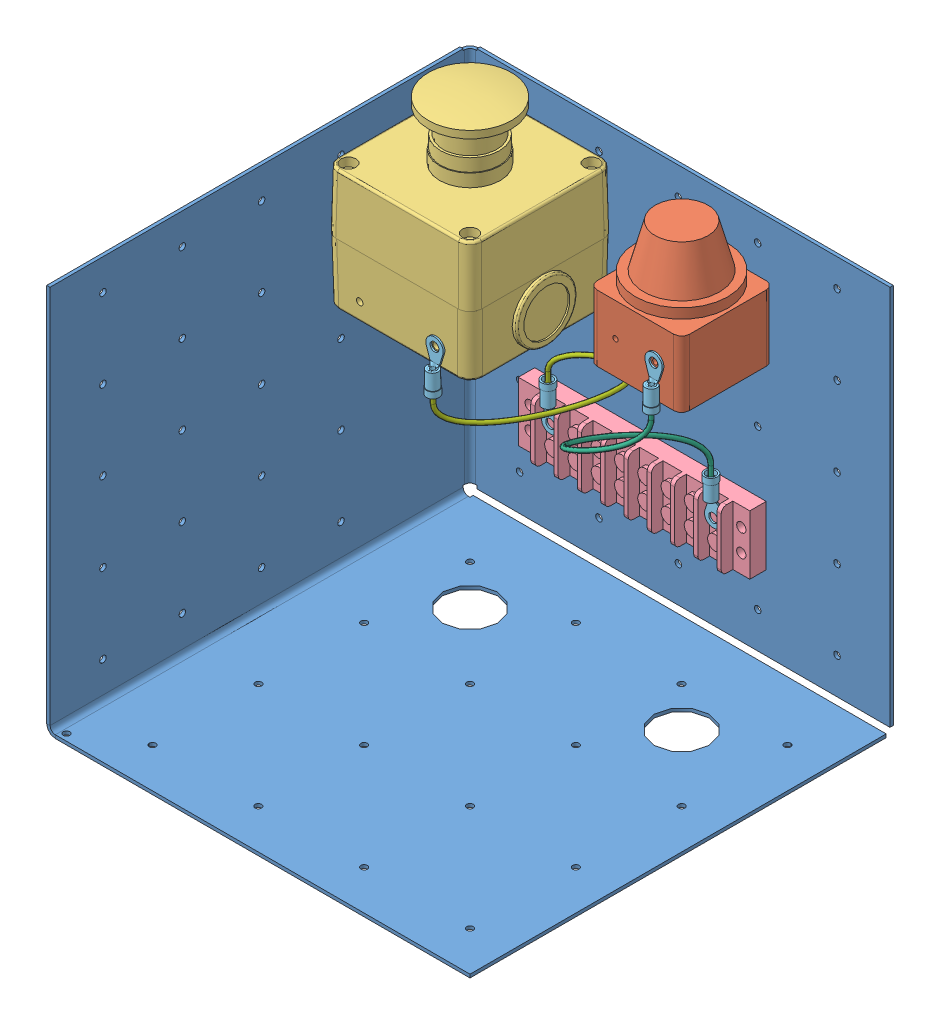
SolidWorks assembly Split_Route.SLDASM, configuration Default (file format 13000). Lengths in mm.
Overall size (203.2 215.84 203.2).
12 component instances, 7 part files, 9 mates.
Components (placement in the parent):
- box4-1: box4.SLDPRT [Default] at origin size (203.2 186.37 203.2)
- light_4-1: light_4.SLDPRT [Default] at (292.1 186.3725 177.8) x (-1 0 0) z (0 -1 0) size (44.45 44.45 58.74)
- E-StopSwitch_4-1: E-StopSwitch_4.SLDPRT [Default] at (50.8 157.9245 50.8) x (0 0 1) z (0 1 0) size (70 92.29 87.45)
- SW3dPS-Terminal Block_4-2: SW3dPS-Terminal Block_4.SLDPRT [Default] at (143.764 67.6275 1.5875) x (-1 0 0) z (0 0 1) size (111.13 28.45 19.91)
- Line_B-1: Line_B.sldasm [Default] at origin size (52.07 120.14 69.94)
  - ring_term_awg-14_4-15: ring_term_awg-14_4.SLDPRT [Default] at (129.032 58.7375 12.2873) x (0 1 0) z (1 0 0) size (27.02 6.1 8.38)
  - ring_term_awg-14_4-16: ring_term_awg-14_4.SLDPRT [Default] at (161.925 170.4975 73.8188) x (0 -1 0) z (-1 0 0) size (27.02 6.1 8.38)
  - Cable-Ring_0-6_4-1: Cable-Ring_0-6_4.sldprt [Default] at origin size (48.88 86.11 67.9)
- Line_A-1: Line_A.sldasm [Default] at origin size (47.09 86.58 83.79)
  - ring_term_awg-14_4-15: ring_term_awg-14_4.SLDPRT [Default] at (69.1868 136.9038 86.227) x (0 -0.999848 -0.017452) z (-1 0 0) size (27.02 6.1 8.38)
  - ring_term_awg-14_4-16: ring_term_awg-14_4.SLDPRT [Default] at (50.8 58.7375 12.2873) x (0 1 0) z (1 0 0) size (27.02 6.1 8.38)
  - Cable-Ring_0-6-001_4-1: Cable-Ring_0-6-001_4.sldprt [Default] at origin size (43.9 52.51 81.44)
Mates (geometry in assembly coordinates):
- Coincident3: coincident: line of box4-1 through (1.5875 186.3725 4.9213) axis (0 0 1); plane of E-StopSwitch_4-1 through (15.8 186.3725 15.8) normal (0 1 0)
- Concentric3: concentric: cylinder of box4-1 through (50.8 0 50.8) axis (0 -1 0) radius 13.081; cylinder of E-StopSwitch_4-1 through (50.8 192.4685 50.8) axis (0 -1 0) radius 14.5415
- Coincident5: coincident: line of box4-1 through (203.2 186.3725 1.5875) axis (-1 0 0); plane of light_4-1 through (133.985 186.3725 32.385) normal (0 1 0)
- Concentric4: concentric: cylinder of box4-1 through (152.4 0 50.8) axis (0 -1 0) radius 13.081; cylinder of light_4-1 through (152.4 186.3725 50.8) axis (0 -1 0) radius 22.225
- Parallel2: parallel: plane of light_4-1 through (133.985 154.6225 28.575) normal (0 0 -1); plane of box4-1 through (203.2 0 1.5875) normal (0 0 1)
- Parallel4: parallel: plane of box4-1 through (1.5875 190.5 203.2) normal (1 0 0); line of E-StopSwitch_4-1 through (85.8 157.9245 80.2636) axis (0 0 -1)
- Coincident142: coincident: plane of box4-1 through (203.2 0 1.5875) normal (0 0 1); plane of SW3dPS-Terminal Block_4-2 through (143.764 67.6275 1.5875) normal (0 0 -1)
- Parallel5: parallel: line of box4-1 through (203.2 3.3836 1.5875) axis (0 1 0); plane of SW3dPS-Terminal Block_4-2 through (143.764 67.6275 9.4615) normal (1 0 0)
- Concentric6: concentric: cylinder of box4-1 through (139.7 58.7375 1.5875) axis (0 0 1) radius 1.5875; cylinder of SW3dPS-Terminal Block_4-2 through (139.7 58.7375 1.5875) axis (0 0 1) radius 2.286
